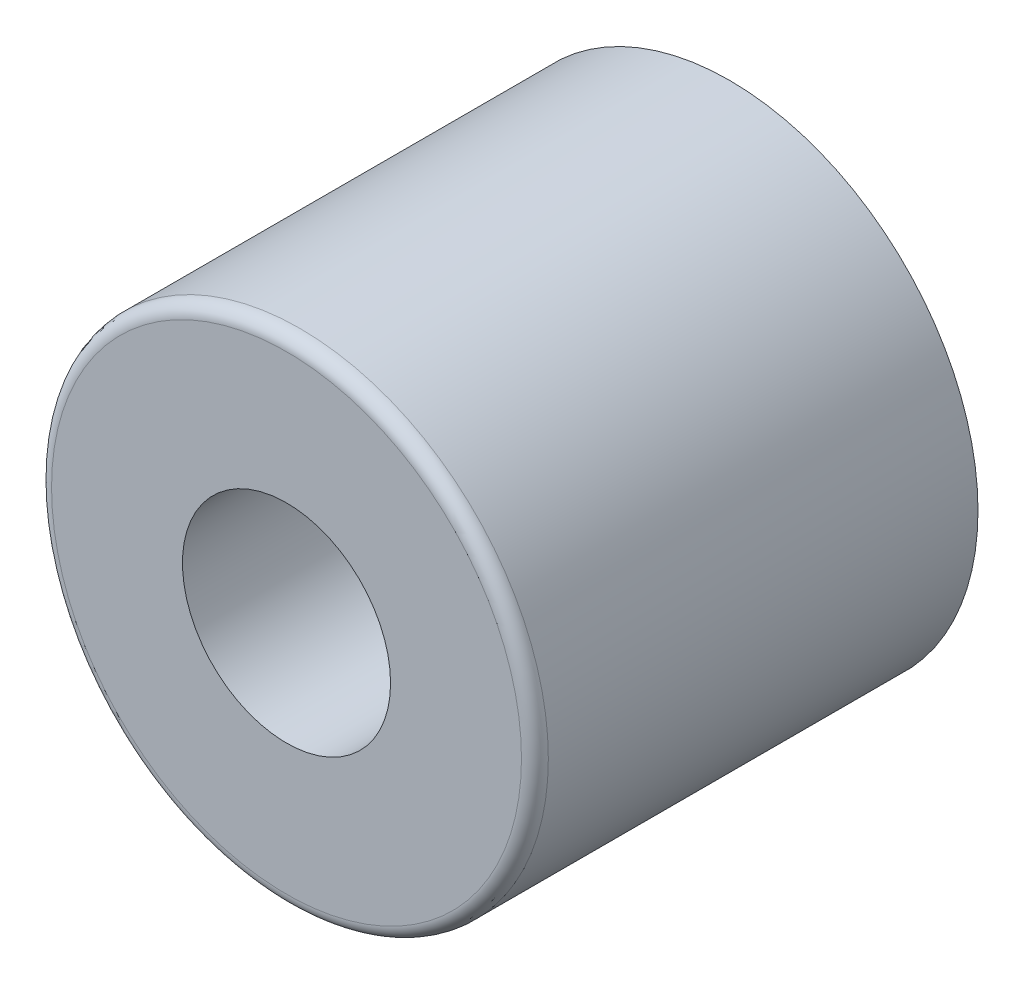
from build123d import *

# Parameters (mm, degrees)
ESQUISSE1_R          = 18.5
ESQUISSE1_R_2        = 7.75
BASE_EXTRUSION_DEPTH = 33
CONG_1_R             = 1


with BuildPart() as part:
    # Esquisse1 → Base-Extrusion (new body)
    with BuildSketch(Plane.XY):
        Circle(ESQUISSE1_R)
        Circle(ESQUISSE1_R_2, mode=Mode.SUBTRACT)
    extrude(amount=BASE_EXTRUSION_DEPTH)

    # Cong_1
    cong_1_edges = [part.edges().sort_by_distance(p)[0] for p in [
        (-18.5, 0, 33),
    ]]
    fillet(cong_1_edges, radius=CONG_1_R)


solid = part.part
